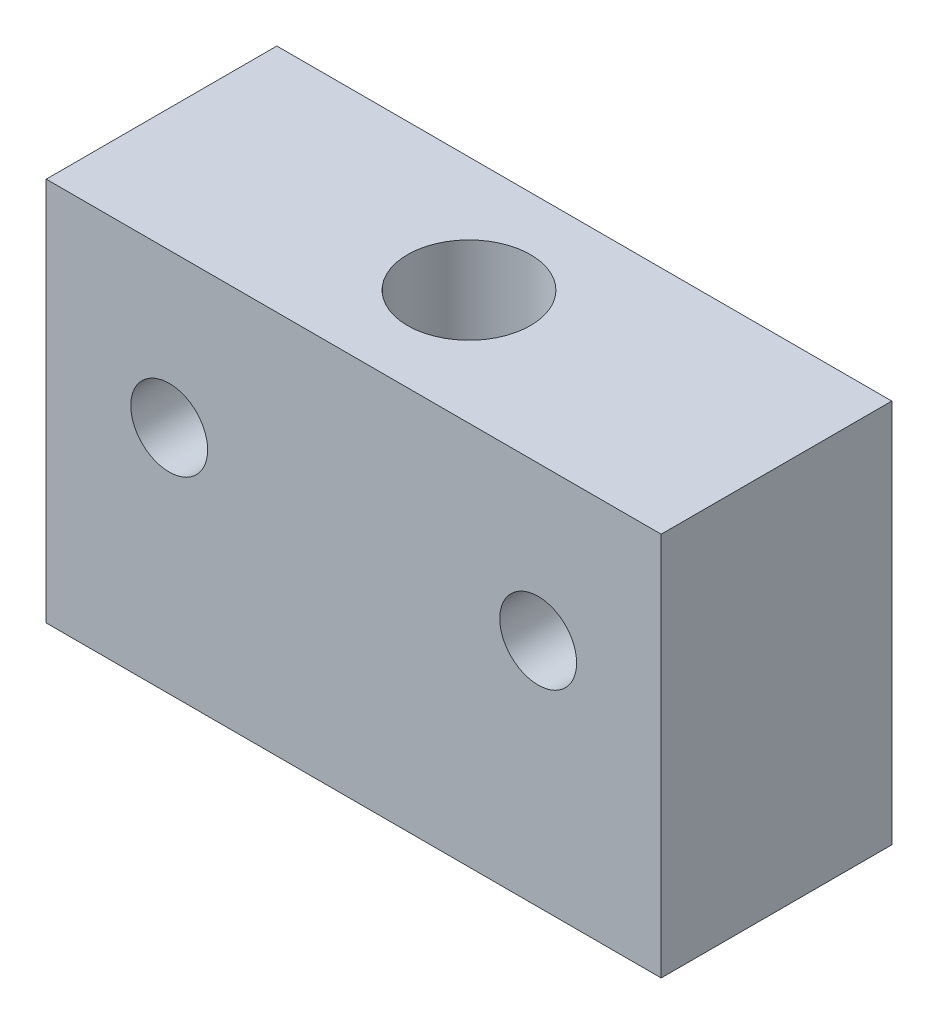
from build123d import *

# Parameters (mm, degrees)
ESQUISSE1_W               = 40
ESQUISSE1_H               = 25
BASE_EXTRUSION_DEPTH      = 15
ESQUISSE2_R               = 4
ENL_V_MAT_EXTRU_1_DEPTH   = 35
TROU_TARAUD_M6X1_01_D     = 5
TROU_TARAUD_M6X1_01_DEPTH = 20
TROU_TARAUD_M6X1_01_TIP   = 1.502151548


with BuildPart() as part:
    # Esquisse1 → Base-Extrusion (new body)
    with BuildSketch(Plane.XY):
        with Locations((-49.973130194, 11.123407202)):
            Rectangle(ESQUISSE1_W, ESQUISSE1_H)
    extrude(amount=BASE_EXTRUSION_DEPTH)

    # Esquisse2 → Enl_v. mat.-Extru.1 (cut)
    with BuildSketch(Plane(origin=(0, 23.623407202, 0), x_dir=(-1, 0, 0), z_dir=(0, 1, 0))):
        with Locations(Location((49.973130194, 7.5, 0), (0, 0, 90))):
            Circle(ESQUISSE2_R)
    extrude(amount=-ENL_V_MAT_EXTRU_1_DEPTH, mode=Mode.SUBTRACT)

    # Trou taraud_ M6x1.01
    with Locations(Plane.XY.offset(15)):
        with Locations((-61.973130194, 13.623407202), (-37.973130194, 13.623407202)):
            Hole(TROU_TARAUD_M6X1_01_D / 2, depth=TROU_TARAUD_M6X1_01_DEPTH)
            with Locations((0, 0, -(TROU_TARAUD_M6X1_01_DEPTH + TROU_TARAUD_M6X1_01_TIP / 2))):  # 118° drill point
                Cone(0, TROU_TARAUD_M6X1_01_D / 2, TROU_TARAUD_M6X1_01_TIP, mode=Mode.SUBTRACT)


solid = part.part
